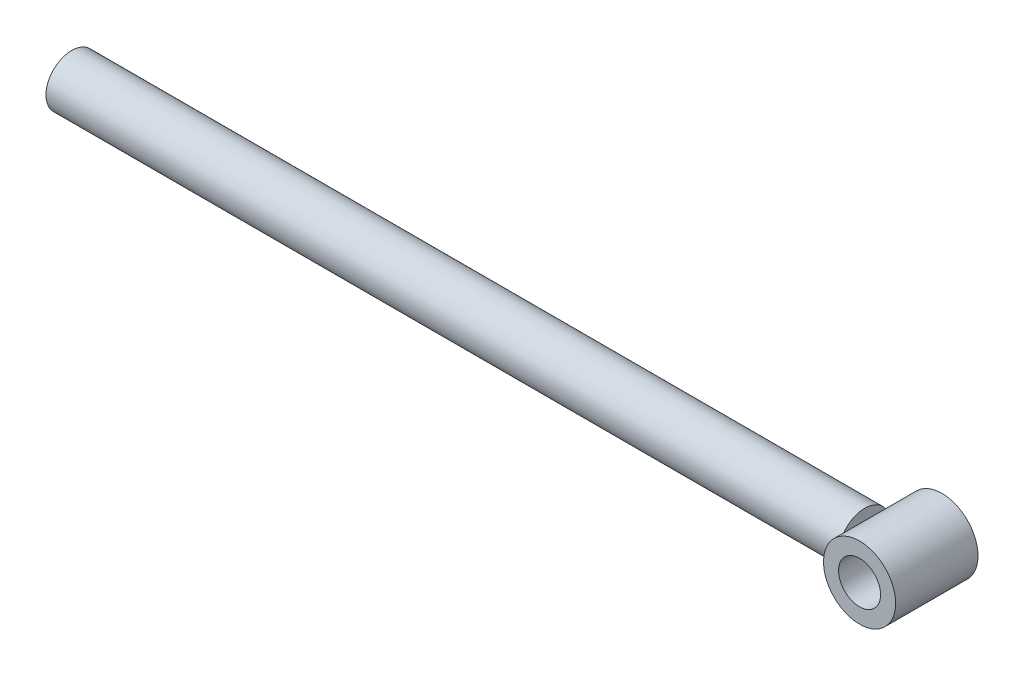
ISO-10303-21;
HEADER;
FILE_DESCRIPTION(('STEP AP214'),'2;1');
FILE_NAME('part.step','',(''),(''),'','','');
FILE_SCHEMA(('AUTOMOTIVE_DESIGN { 1 0 10303 214 1 1 1 1 }'));
ENDSEC;
DATA;
#1=APPLICATION_CONTEXT('core data for automotive mechanical design processes');
#2=APPLICATION_PROTOCOL_DEFINITION('international standard','automotive_design',2000,#1);
#3=PRODUCT_CONTEXT('',#1,'mechanical');
#4=PRODUCT('Part','Part','',(#3));
#5=PRODUCT_RELATED_PRODUCT_CATEGORY('part','',(#4));
#6=PRODUCT_DEFINITION_FORMATION('','',#4);
#7=PRODUCT_DEFINITION_CONTEXT('part definition',#1,'design');
#8=PRODUCT_DEFINITION('design','',#6,#7);
#9=PRODUCT_DEFINITION_SHAPE('','',#8);
#10=(LENGTH_UNIT() NAMED_UNIT(*) SI_UNIT(.MILLI.,.METRE.));
#11=(NAMED_UNIT(*) PLANE_ANGLE_UNIT() SI_UNIT($,.RADIAN.));
#12=(NAMED_UNIT(*) SI_UNIT($,.STERADIAN.) SOLID_ANGLE_UNIT());
#13=UNCERTAINTY_MEASURE_WITH_UNIT(LENGTH_MEASURE(1.E-05),#10,'distance_accuracy_value','');
#14=(GEOMETRIC_REPRESENTATION_CONTEXT(3) GLOBAL_UNCERTAINTY_ASSIGNED_CONTEXT((#13)) GLOBAL_UNIT_ASSIGNED_CONTEXT((#10,
#11,#12)) REPRESENTATION_CONTEXT('',''));
#15=CARTESIAN_POINT('',(0.,0.,0.));
#16=DIRECTION('',(0.,0.,1.));
#17=DIRECTION('',(1.,0.,0.));
#18=AXIS2_PLACEMENT_3D('',#15,#16,#17);
#19=CARTESIAN_POINT('',(402.5,0.,20.));
#20=DIRECTION('',(0.,0.,1.));
#21=DIRECTION('',(1.,0.,0.));
#22=AXIS2_PLACEMENT_3D('',#19,#20,#21);
#23=PLANE('',#22);
#24=CARTESIAN_POINT('',(402.5,0.,20.));
#25=DIRECTION('',(0.,0.,1.));
#26=DIRECTION('',(1.,0.,0.));
#27=AXIS2_PLACEMENT_3D('',#24,#25,#26);
#28=CIRCLE('',#27,17.4999999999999);
#29=CARTESIAN_POINT('',(420.,0.,20.));
#30=VERTEX_POINT('',#29);
#31=EDGE_CURVE('E11',#30,#30,#28,.T.);
#32=ORIENTED_EDGE('',*,*,#31,.T.);
#33=EDGE_LOOP('',(#32));
#34=FACE_BOUND('',#33,.T.);
#35=CARTESIAN_POINT('',(402.5,0.,20.));
#36=DIRECTION('',(0.,0.,1.));
#37=DIRECTION('',(1.,0.,0.));
#38=AXIS2_PLACEMENT_3D('',#35,#36,#37);
#39=CIRCLE('',#38,10.2);
#40=CARTESIAN_POINT('',(412.7,0.,20.));
#41=VERTEX_POINT('',#40);
#42=EDGE_CURVE('E47',#41,#41,#39,.T.);
#43=ORIENTED_EDGE('',*,*,#42,.F.);
#44=EDGE_LOOP('',(#43));
#45=FACE_BOUND('',#44,.T.);
#46=ADVANCED_FACE('F36',(#34,#45),#23,.T.);
#47=CARTESIAN_POINT('',(402.5,0.,-20.));
#48=DIRECTION('',(0.,0.,1.));
#49=DIRECTION('',(1.,0.,0.));
#50=AXIS2_PLACEMENT_3D('',#47,#48,#49);
#51=PLANE('',#50);
#52=CARTESIAN_POINT('',(402.5,0.,-20.));
#53=DIRECTION('',(0.,0.,1.));
#54=DIRECTION('',(1.,0.,0.));
#55=AXIS2_PLACEMENT_3D('',#52,#53,#54);
#56=CIRCLE('',#55,17.4999999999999);
#57=CARTESIAN_POINT('',(420.,0.,-20.));
#58=VERTEX_POINT('',#57);
#59=EDGE_CURVE('E40',#58,#58,#56,.T.);
#60=ORIENTED_EDGE('',*,*,#59,.F.);
#61=EDGE_LOOP('',(#60));
#62=FACE_BOUND('',#61,.T.);
#63=CARTESIAN_POINT('',(402.5,0.,-20.));
#64=DIRECTION('',(0.,0.,1.));
#65=DIRECTION('',(1.,0.,0.));
#66=AXIS2_PLACEMENT_3D('',#63,#64,#65);
#67=CIRCLE('',#66,10.2);
#68=CARTESIAN_POINT('',(412.7,0.,-20.));
#69=VERTEX_POINT('',#68);
#70=EDGE_CURVE('E49',#69,#69,#67,.T.);
#71=ORIENTED_EDGE('',*,*,#70,.T.);
#72=EDGE_LOOP('',(#71));
#73=FACE_BOUND('',#72,.T.);
#74=ADVANCED_FACE('F59',(#62,#73),#51,.F.);
#75=CARTESIAN_POINT('',(402.5,0.,20.));
#76=DIRECTION('',(0.,0.,-1.));
#77=DIRECTION('',(-1.,0.,0.));
#78=AXIS2_PLACEMENT_3D('',#75,#76,#77);
#79=CYLINDRICAL_SURFACE('',#78,17.4999999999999);
#80=ORIENTED_EDGE('',*,*,#31,.F.);
#81=EDGE_LOOP('',(#80));
#82=FACE_BOUND('',#81,.T.);
#83=ORIENTED_EDGE('',*,*,#59,.T.);
#84=EDGE_LOOP('',(#83));
#85=FACE_BOUND('',#84,.T.);
#86=ADVANCED_FACE('F38',(#82,#85),#79,.T.);
#87=CARTESIAN_POINT('',(402.5,0.,20.));
#88=DIRECTION('',(0.,0.,-1.));
#89=DIRECTION('',(-1.,0.,0.));
#90=AXIS2_PLACEMENT_3D('',#87,#88,#89);
#91=CYLINDRICAL_SURFACE('',#90,10.2);
#92=ORIENTED_EDGE('',*,*,#42,.T.);
#93=EDGE_LOOP('',(#92));
#94=FACE_BOUND('',#93,.T.);
#95=ORIENTED_EDGE('',*,*,#70,.F.);
#96=EDGE_LOOP('',(#95));
#97=FACE_BOUND('',#96,.T.);
#98=ADVANCED_FACE('F55',(#94,#97),#91,.F.);
#99=CLOSED_SHELL('',(#46,#74,#86,#98));
#100=MANIFOLD_SOLID_BREP('B2',#99);
#101=CARTESIAN_POINT('',(385.,0.,0.));
#102=DIRECTION('',(-1.,0.,0.));
#103=DIRECTION('',(0.,0.,1.));
#104=AXIS2_PLACEMENT_3D('',#101,#102,#103);
#105=CYLINDRICAL_SURFACE('',#104,12.5);
#106=CARTESIAN_POINT('',(385.,0.,0.));
#107=DIRECTION('',(1.,0.,0.));
#108=DIRECTION('',(0.,0.,-1.));
#109=AXIS2_PLACEMENT_3D('',#106,#107,#108);
#110=CIRCLE('',#109,12.5);
#111=CARTESIAN_POINT('',(385.,0.,-12.5));
#112=VERTEX_POINT('',#111);
#113=EDGE_CURVE('E35',#112,#112,#110,.T.);
#114=ORIENTED_EDGE('',*,*,#113,.F.);
#115=EDGE_LOOP('',(#114));
#116=FACE_BOUND('',#115,.T.);
#117=CARTESIAN_POINT('',(0.,0.,0.));
#118=DIRECTION('',(1.,0.,0.));
#119=DIRECTION('',(0.,0.,-1.));
#120=AXIS2_PLACEMENT_3D('',#117,#118,#119);
#121=CIRCLE('',#120,12.5);
#122=CARTESIAN_POINT('',(0.,0.,-12.5));
#123=VERTEX_POINT('',#122);
#124=EDGE_CURVE('E100',#123,#123,#121,.T.);
#125=ORIENTED_EDGE('',*,*,#124,.T.);
#126=EDGE_LOOP('',(#125));
#127=FACE_BOUND('',#126,.T.);
#128=ADVANCED_FACE('F97',(#116,#127),#105,.T.);
#129=CARTESIAN_POINT('',(385.,0.,0.));
#130=DIRECTION('',(1.,0.,0.));
#131=DIRECTION('',(0.,0.,-1.));
#132=AXIS2_PLACEMENT_3D('',#129,#130,#131);
#133=PLANE('',#132);
#134=ORIENTED_EDGE('',*,*,#113,.T.);
#135=EDGE_LOOP('',(#134));
#136=FACE_BOUND('',#135,.T.);
#137=ADVANCED_FACE('F112',(#136),#133,.T.);
#138=CARTESIAN_POINT('',(0.,0.,0.));
#139=DIRECTION('',(1.,0.,0.));
#140=DIRECTION('',(0.,0.,-1.));
#141=AXIS2_PLACEMENT_3D('',#138,#139,#140);
#142=PLANE('',#141);
#143=ORIENTED_EDGE('',*,*,#124,.F.);
#144=EDGE_LOOP('',(#143));
#145=FACE_BOUND('',#144,.T.);
#146=ADVANCED_FACE('F110',(#145),#142,.F.);
#147=CLOSED_SHELL('',(#128,#137,#146));
#148=MANIFOLD_SOLID_BREP('B6',#147);
#149=ADVANCED_BREP_SHAPE_REPRESENTATION('',(#18,#100,#148),#14);
#150=SHAPE_DEFINITION_REPRESENTATION(#9,#149);
ENDSEC;
END-ISO-10303-21;
